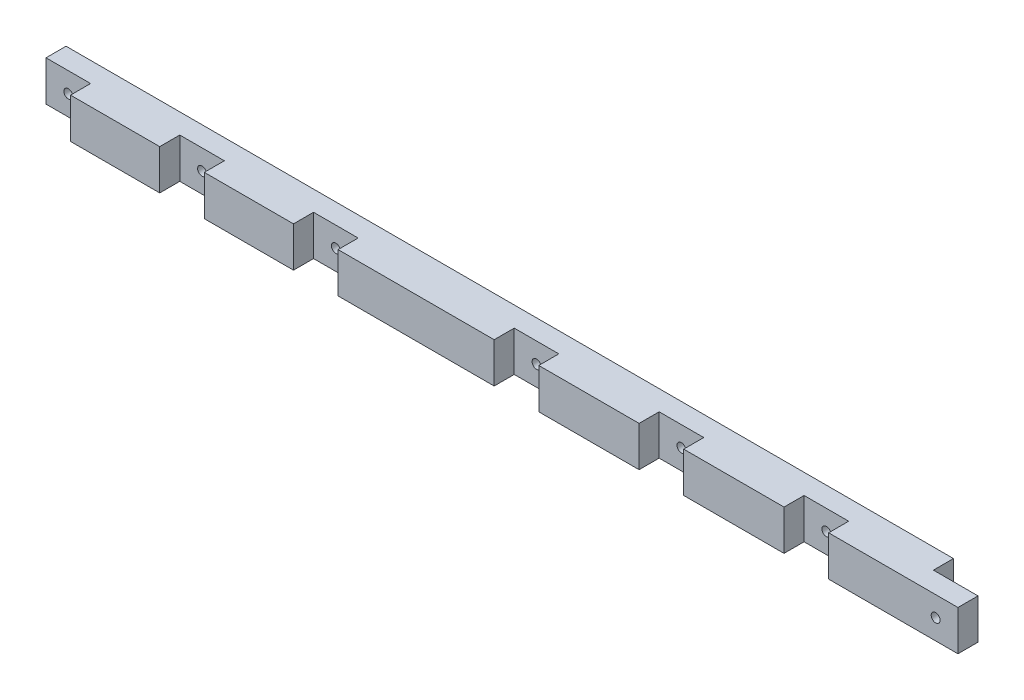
ISO-10303-21;
HEADER;
FILE_DESCRIPTION(('STEP AP214'),'2;1');
FILE_NAME('part.step','',(''),(''),'','','');
FILE_SCHEMA(('AUTOMOTIVE_DESIGN { 1 0 10303 214 1 1 1 1 }'));
ENDSEC;
DATA;
#1=APPLICATION_CONTEXT('core data for automotive mechanical design processes');
#2=APPLICATION_PROTOCOL_DEFINITION('international standard','automotive_design',2000,#1);
#3=PRODUCT_CONTEXT('',#1,'mechanical');
#4=PRODUCT('Part','Part','',(#3));
#5=PRODUCT_RELATED_PRODUCT_CATEGORY('part','',(#4));
#6=PRODUCT_DEFINITION_FORMATION('','',#4);
#7=PRODUCT_DEFINITION_CONTEXT('part definition',#1,'design');
#8=PRODUCT_DEFINITION('design','',#6,#7);
#9=PRODUCT_DEFINITION_SHAPE('','',#8);
#10=(LENGTH_UNIT() NAMED_UNIT(*) SI_UNIT(.MILLI.,.METRE.));
#11=(NAMED_UNIT(*) PLANE_ANGLE_UNIT() SI_UNIT($,.RADIAN.));
#12=(NAMED_UNIT(*) SI_UNIT($,.STERADIAN.) SOLID_ANGLE_UNIT());
#13=UNCERTAINTY_MEASURE_WITH_UNIT(LENGTH_MEASURE(1.E-05),#10,'distance_accuracy_value','');
#14=(GEOMETRIC_REPRESENTATION_CONTEXT(3) GLOBAL_UNCERTAINTY_ASSIGNED_CONTEXT((#13)) GLOBAL_UNIT_ASSIGNED_CONTEXT((#10,
#11,#12)) REPRESENTATION_CONTEXT('',''));
#15=CARTESIAN_POINT('',(0.,0.,0.));
#16=DIRECTION('',(0.,0.,1.));
#17=DIRECTION('',(1.,0.,0.));
#18=AXIS2_PLACEMENT_3D('',#15,#16,#17);
#19=CARTESIAN_POINT('',(209.,0.,9.));
#20=DIRECTION('',(-1.,0.,0.));
#21=DIRECTION('',(0.,0.,1.));
#22=AXIS2_PLACEMENT_3D('',#19,#20,#21);
#23=PLANE('',#22);
#24=DIRECTION('',(0.,-1.,0.));
#25=VECTOR('',#24,1.);
#26=CARTESIAN_POINT('',(209.,9.,4.5));
#27=LINE('',#26,#25);
#28=CARTESIAN_POINT('',(209.,9.,4.5));
#29=VERTEX_POINT('',#28);
#30=CARTESIAN_POINT('',(209.,0.,4.5));
#31=VERTEX_POINT('',#30);
#32=EDGE_CURVE('E215',#29,#31,#27,.T.);
#33=ORIENTED_EDGE('',*,*,#32,.F.);
#34=DIRECTION('',(0.,0.,-1.));
#35=VECTOR('',#34,1.);
#36=CARTESIAN_POINT('',(209.,9.,9.));
#37=LINE('',#36,#35);
#38=CARTESIAN_POINT('',(209.,9.,9.));
#39=VERTEX_POINT('',#38);
#40=EDGE_CURVE('E237',#39,#29,#37,.T.);
#41=ORIENTED_EDGE('',*,*,#40,.F.);
#42=DIRECTION('',(0.,1.,0.));
#43=VECTOR('',#42,1.);
#44=CARTESIAN_POINT('',(209.,0.,9.));
#45=LINE('',#44,#43);
#46=CARTESIAN_POINT('',(209.,0.,9.));
#47=VERTEX_POINT('',#46);
#48=EDGE_CURVE('E236',#47,#39,#45,.T.);
#49=ORIENTED_EDGE('',*,*,#48,.F.);
#50=DIRECTION('',(0.,0.,-1.));
#51=VECTOR('',#50,1.);
#52=CARTESIAN_POINT('',(209.,0.,9.));
#53=LINE('',#52,#51);
#54=EDGE_CURVE('E39',#47,#31,#53,.T.);
#55=ORIENTED_EDGE('',*,*,#54,.T.);
#56=EDGE_LOOP('',(#33,#41,#49,#55));
#57=FACE_BOUND('',#56,.T.);
#58=ADVANCED_FACE('F31',(#57),#23,.F.);
#59=CARTESIAN_POINT('',(0.,9.,9.));
#60=DIRECTION('',(0.,0.,-1.));
#61=DIRECTION('',(-1.,0.,0.));
#62=AXIS2_PLACEMENT_3D('',#59,#60,#61);
#63=PLANE('',#62);
#64=DIRECTION('',(1.,0.,0.));
#65=VECTOR('',#64,1.);
#66=CARTESIAN_POINT('',(0.,0.,9.));
#67=LINE('',#66,#65);
#68=CARTESIAN_POINT('',(147.5,0.,9.));
#69=VERTEX_POINT('',#68);
#70=CARTESIAN_POINT('',(170.,0.,9.));
#71=VERTEX_POINT('',#70);
#72=EDGE_CURVE('E517',#69,#71,#67,.T.);
#73=ORIENTED_EDGE('',*,*,#72,.T.);
#74=DIRECTION('',(0.,-1.,0.));
#75=VECTOR('',#74,1.);
#76=CARTESIAN_POINT('',(170.,0.,9.));
#77=LINE('',#76,#75);
#78=CARTESIAN_POINT('',(170.,9.,9.));
#79=VERTEX_POINT('',#78);
#80=EDGE_CURVE('E430',#79,#71,#77,.T.);
#81=ORIENTED_EDGE('',*,*,#80,.F.);
#82=DIRECTION('',(-1.,0.,0.));
#83=VECTOR('',#82,1.);
#84=CARTESIAN_POINT('',(0.,9.,9.));
#85=LINE('',#84,#83);
#86=CARTESIAN_POINT('',(147.5,9.,9.));
#87=VERTEX_POINT('',#86);
#88=EDGE_CURVE('E255',#79,#87,#85,.T.);
#89=ORIENTED_EDGE('',*,*,#88,.T.);
#90=DIRECTION('',(0.,1.,0.));
#91=VECTOR('',#90,1.);
#92=CARTESIAN_POINT('',(147.5,0.,9.));
#93=LINE('',#92,#91);
#94=EDGE_CURVE('E395',#69,#87,#93,.T.);
#95=ORIENTED_EDGE('',*,*,#94,.F.);
#96=EDGE_LOOP('',(#73,#81,#89,#95));
#97=FACE_BOUND('',#96,.T.);
#98=ADVANCED_FACE('F480',(#97),#63,.F.);
#99=CARTESIAN_POINT('',(115.,0.,9.));
#100=VERTEX_POINT('',#99);
#101=CARTESIAN_POINT('',(137.5,0.,9.));
#102=VERTEX_POINT('',#101);
#103=EDGE_CURVE('E519',#100,#102,#67,.T.);
#104=ORIENTED_EDGE('',*,*,#103,.T.);
#105=DIRECTION('',(0.,-1.,0.));
#106=VECTOR('',#105,1.);
#107=CARTESIAN_POINT('',(137.5,0.,9.));
#108=LINE('',#107,#106);
#109=CARTESIAN_POINT('',(137.5,9.,9.));
#110=VERTEX_POINT('',#109);
#111=EDGE_CURVE('E399',#110,#102,#108,.T.);
#112=ORIENTED_EDGE('',*,*,#111,.F.);
#113=CARTESIAN_POINT('',(115.,9.,9.));
#114=VERTEX_POINT('',#113);
#115=EDGE_CURVE('E553',#110,#114,#85,.T.);
#116=ORIENTED_EDGE('',*,*,#115,.T.);
#117=DIRECTION('',(0.,1.,0.));
#118=VECTOR('',#117,1.);
#119=CARTESIAN_POINT('',(115.,0.,9.));
#120=LINE('',#119,#118);
#121=EDGE_CURVE('E362',#100,#114,#120,.T.);
#122=ORIENTED_EDGE('',*,*,#121,.F.);
#123=EDGE_LOOP('',(#104,#112,#116,#122));
#124=FACE_BOUND('',#123,.T.);
#125=ADVANCED_FACE('F485',(#124),#63,.F.);
#126=CARTESIAN_POINT('',(70.,0.,9.));
#127=VERTEX_POINT('',#126);
#128=CARTESIAN_POINT('',(105.,0.,9.));
#129=VERTEX_POINT('',#128);
#130=EDGE_CURVE('E524',#127,#129,#67,.T.);
#131=ORIENTED_EDGE('',*,*,#130,.T.);
#132=DIRECTION('',(0.,-1.,0.));
#133=VECTOR('',#132,1.);
#134=CARTESIAN_POINT('',(105.,0.,9.));
#135=LINE('',#134,#133);
#136=CARTESIAN_POINT('',(105.,9.,9.));
#137=VERTEX_POINT('',#136);
#138=EDGE_CURVE('E366',#137,#129,#135,.T.);
#139=ORIENTED_EDGE('',*,*,#138,.F.);
#140=CARTESIAN_POINT('',(70.,9.,9.));
#141=VERTEX_POINT('',#140);
#142=EDGE_CURVE('E552',#137,#141,#85,.T.);
#143=ORIENTED_EDGE('',*,*,#142,.T.);
#144=DIRECTION('',(0.,1.,0.));
#145=VECTOR('',#144,1.);
#146=CARTESIAN_POINT('',(70.,0.,9.));
#147=LINE('',#146,#145);
#148=EDGE_CURVE('E329',#127,#141,#147,.T.);
#149=ORIENTED_EDGE('',*,*,#148,.F.);
#150=EDGE_LOOP('',(#131,#139,#143,#149));
#151=FACE_BOUND('',#150,.T.);
#152=ADVANCED_FACE('F645',(#151),#63,.F.);
#153=CARTESIAN_POINT('',(40.,0.,9.));
#154=VERTEX_POINT('',#153);
#155=CARTESIAN_POINT('',(60.,0.,9.));
#156=VERTEX_POINT('',#155);
#157=EDGE_CURVE('E261',#154,#156,#67,.T.);
#158=ORIENTED_EDGE('',*,*,#157,.T.);
#159=DIRECTION('',(0.,-1.,0.));
#160=VECTOR('',#159,1.);
#161=CARTESIAN_POINT('',(60.,0.,9.));
#162=LINE('',#161,#160);
#163=CARTESIAN_POINT('',(60.,9.,9.));
#164=VERTEX_POINT('',#163);
#165=EDGE_CURVE('E333',#164,#156,#162,.T.);
#166=ORIENTED_EDGE('',*,*,#165,.F.);
#167=CARTESIAN_POINT('',(40.,9.,9.));
#168=VERTEX_POINT('',#167);
#169=EDGE_CURVE('E550',#164,#168,#85,.T.);
#170=ORIENTED_EDGE('',*,*,#169,.T.);
#171=DIRECTION('',(0.,1.,0.));
#172=VECTOR('',#171,1.);
#173=CARTESIAN_POINT('',(40.,0.,9.));
#174=LINE('',#173,#172);
#175=EDGE_CURVE('E296',#154,#168,#174,.T.);
#176=ORIENTED_EDGE('',*,*,#175,.F.);
#177=EDGE_LOOP('',(#158,#166,#170,#176));
#178=FACE_BOUND('',#177,.T.);
#179=ADVANCED_FACE('F502',(#178),#63,.F.);
#180=CARTESIAN_POINT('',(10.,0.,9.));
#181=VERTEX_POINT('',#180);
#182=CARTESIAN_POINT('',(30.,0.,9.));
#183=VERTEX_POINT('',#182);
#184=EDGE_CURVE('E258',#181,#183,#67,.T.);
#185=ORIENTED_EDGE('',*,*,#184,.T.);
#186=DIRECTION('',(0.,-1.,0.));
#187=VECTOR('',#186,1.);
#188=CARTESIAN_POINT('',(30.,0.,9.));
#189=LINE('',#188,#187);
#190=CARTESIAN_POINT('',(30.,9.,9.));
#191=VERTEX_POINT('',#190);
#192=EDGE_CURVE('E300',#191,#183,#189,.T.);
#193=ORIENTED_EDGE('',*,*,#192,.F.);
#194=CARTESIAN_POINT('',(10.,9.,9.));
#195=VERTEX_POINT('',#194);
#196=EDGE_CURVE('E256',#191,#195,#85,.T.);
#197=ORIENTED_EDGE('',*,*,#196,.T.);
#198=DIRECTION('',(0.,1.,0.));
#199=VECTOR('',#198,1.);
#200=CARTESIAN_POINT('',(10.,0.,9.));
#201=LINE('',#200,#199);
#202=EDGE_CURVE('E267',#181,#195,#201,.T.);
#203=ORIENTED_EDGE('',*,*,#202,.F.);
#204=EDGE_LOOP('',(#185,#193,#197,#203));
#205=FACE_BOUND('',#204,.T.);
#206=ADVANCED_FACE('F497',(#205),#63,.F.);
#207=CARTESIAN_POINT('',(0.,0.,9.));
#208=DIRECTION('',(1.,0.,0.));
#209=DIRECTION('',(0.,0.,-1.));
#210=AXIS2_PLACEMENT_3D('',#207,#208,#209);
#211=PLANE('',#210);
#212=DIRECTION('',(0.,0.,-1.));
#213=VECTOR('',#212,1.);
#214=CARTESIAN_POINT('',(0.,0.,9.));
#215=LINE('',#214,#213);
#216=CARTESIAN_POINT('',(0.,0.,4.5));
#217=VERTEX_POINT('',#216);
#218=CARTESIAN_POINT('',(0.,0.,0.));
#219=VERTEX_POINT('',#218);
#220=EDGE_CURVE('E11',#217,#219,#215,.T.);
#221=ORIENTED_EDGE('',*,*,#220,.F.);
#222=DIRECTION('',(0.,-1.,0.));
#223=VECTOR('',#222,1.);
#224=CARTESIAN_POINT('',(0.,0.,4.5));
#225=LINE('',#224,#223);
#226=CARTESIAN_POINT('',(0.,9.,4.5));
#227=VERTEX_POINT('',#226);
#228=EDGE_CURVE('E270',#227,#217,#225,.T.);
#229=ORIENTED_EDGE('',*,*,#228,.F.);
#230=DIRECTION('',(0.,0.,-1.));
#231=VECTOR('',#230,1.);
#232=CARTESIAN_POINT('',(0.,9.,9.));
#233=LINE('',#232,#231);
#234=CARTESIAN_POINT('',(0.,9.,0.));
#235=VERTEX_POINT('',#234);
#236=EDGE_CURVE('E238',#227,#235,#233,.T.);
#237=ORIENTED_EDGE('',*,*,#236,.T.);
#238=DIRECTION('',(0.,-1.,0.));
#239=VECTOR('',#238,1.);
#240=CARTESIAN_POINT('',(0.,0.,0.));
#241=LINE('',#240,#239);
#242=EDGE_CURVE('E249',#235,#219,#241,.T.);
#243=ORIENTED_EDGE('',*,*,#242,.T.);
#244=EDGE_LOOP('',(#221,#229,#237,#243));
#245=FACE_BOUND('',#244,.T.);
#246=ADVANCED_FACE('F33',(#245),#211,.F.);
#247=CARTESIAN_POINT('',(0.,0.,9.));
#248=DIRECTION('',(0.,1.,0.));
#249=DIRECTION('',(0.,0.,1.));
#250=AXIS2_PLACEMENT_3D('',#247,#248,#249);
#251=PLANE('',#250);
#252=DIRECTION('',(1.,0.,0.));
#253=VECTOR('',#252,1.);
#254=CARTESIAN_POINT('',(0.,0.,0.));
#255=LINE('',#254,#253);
#256=CARTESIAN_POINT('',(199.,0.,0.));
#257=VERTEX_POINT('',#256);
#258=EDGE_CURVE('E247',#219,#257,#255,.T.);
#259=ORIENTED_EDGE('',*,*,#258,.T.);
#260=DIRECTION('',(0.,0.,-1.));
#261=VECTOR('',#260,1.);
#262=CARTESIAN_POINT('',(199.,0.,4.5));
#263=LINE('',#262,#261);
#264=CARTESIAN_POINT('',(199.,0.,4.5));
#265=VERTEX_POINT('',#264);
#266=EDGE_CURVE('E46',#265,#257,#263,.T.);
#267=ORIENTED_EDGE('',*,*,#266,.F.);
#268=DIRECTION('',(-1.,0.,0.));
#269=VECTOR('',#268,1.);
#270=CARTESIAN_POINT('',(209.,0.,4.5));
#271=LINE('',#270,#269);
#272=EDGE_CURVE('E219',#31,#265,#271,.T.);
#273=ORIENTED_EDGE('',*,*,#272,.F.);
#274=ORIENTED_EDGE('',*,*,#54,.F.);
#275=CARTESIAN_POINT('',(180.,0.,9.));
#276=VERTEX_POINT('',#275);
#277=EDGE_CURVE('E246',#276,#47,#67,.T.);
#278=ORIENTED_EDGE('',*,*,#277,.F.);
#279=DIRECTION('',(0.,0.,1.));
#280=VECTOR('',#279,1.);
#281=CARTESIAN_POINT('',(180.,0.,4.5));
#282=LINE('',#281,#280);
#283=CARTESIAN_POINT('',(180.,0.,4.5));
#284=VERTEX_POINT('',#283);
#285=EDGE_CURVE('E54',#284,#276,#282,.T.);
#286=ORIENTED_EDGE('',*,*,#285,.F.);
#287=DIRECTION('',(1.,0.,0.));
#288=VECTOR('',#287,1.);
#289=CARTESIAN_POINT('',(170.,0.,4.5));
#290=LINE('',#289,#288);
#291=CARTESIAN_POINT('',(170.,0.,4.5));
#292=VERTEX_POINT('',#291);
#293=EDGE_CURVE('E438',#292,#284,#290,.T.);
#294=ORIENTED_EDGE('',*,*,#293,.F.);
#295=DIRECTION('',(0.,0.,1.));
#296=VECTOR('',#295,1.);
#297=CARTESIAN_POINT('',(170.,0.,4.5));
#298=LINE('',#297,#296);
#299=EDGE_CURVE('E418',#292,#71,#298,.T.);
#300=ORIENTED_EDGE('',*,*,#299,.T.);
#301=ORIENTED_EDGE('',*,*,#72,.F.);
#302=DIRECTION('',(0.,0.,1.));
#303=VECTOR('',#302,1.);
#304=CARTESIAN_POINT('',(147.5,0.,4.5));
#305=LINE('',#304,#303);
#306=CARTESIAN_POINT('',(147.5,0.,4.5));
#307=VERTEX_POINT('',#306);
#308=EDGE_CURVE('E388',#307,#69,#305,.T.);
#309=ORIENTED_EDGE('',*,*,#308,.F.);
#310=DIRECTION('',(1.,0.,0.));
#311=VECTOR('',#310,1.);
#312=CARTESIAN_POINT('',(137.5,0.,4.5));
#313=LINE('',#312,#311);
#314=CARTESIAN_POINT('',(137.5,0.,4.5));
#315=VERTEX_POINT('',#314);
#316=EDGE_CURVE('E407',#315,#307,#313,.T.);
#317=ORIENTED_EDGE('',*,*,#316,.F.);
#318=DIRECTION('',(0.,0.,1.));
#319=VECTOR('',#318,1.);
#320=CARTESIAN_POINT('',(137.5,0.,4.5));
#321=LINE('',#320,#319);
#322=EDGE_CURVE('E385',#315,#102,#321,.T.);
#323=ORIENTED_EDGE('',*,*,#322,.T.);
#324=ORIENTED_EDGE('',*,*,#103,.F.);
#325=DIRECTION('',(0.,0.,1.));
#326=VECTOR('',#325,1.);
#327=CARTESIAN_POINT('',(115.,0.,4.5));
#328=LINE('',#327,#326);
#329=CARTESIAN_POINT('',(115.,0.,4.5));
#330=VERTEX_POINT('',#329);
#331=EDGE_CURVE('E355',#330,#100,#328,.T.);
#332=ORIENTED_EDGE('',*,*,#331,.F.);
#333=DIRECTION('',(1.,0.,0.));
#334=VECTOR('',#333,1.);
#335=CARTESIAN_POINT('',(105.,0.,4.5));
#336=LINE('',#335,#334);
#337=CARTESIAN_POINT('',(105.,0.,4.5));
#338=VERTEX_POINT('',#337);
#339=EDGE_CURVE('E374',#338,#330,#336,.T.);
#340=ORIENTED_EDGE('',*,*,#339,.F.);
#341=DIRECTION('',(0.,0.,1.));
#342=VECTOR('',#341,1.);
#343=CARTESIAN_POINT('',(105.,0.,4.5));
#344=LINE('',#343,#342);
#345=EDGE_CURVE('E352',#338,#129,#344,.T.);
#346=ORIENTED_EDGE('',*,*,#345,.T.);
#347=ORIENTED_EDGE('',*,*,#130,.F.);
#348=DIRECTION('',(0.,0.,1.));
#349=VECTOR('',#348,1.);
#350=CARTESIAN_POINT('',(70.,0.,4.5));
#351=LINE('',#350,#349);
#352=CARTESIAN_POINT('',(70.,0.,4.5));
#353=VERTEX_POINT('',#352);
#354=EDGE_CURVE('E322',#353,#127,#351,.T.);
#355=ORIENTED_EDGE('',*,*,#354,.F.);
#356=DIRECTION('',(1.,0.,0.));
#357=VECTOR('',#356,1.);
#358=CARTESIAN_POINT('',(60.,0.,4.5));
#359=LINE('',#358,#357);
#360=CARTESIAN_POINT('',(60.,0.,4.5));
#361=VERTEX_POINT('',#360);
#362=EDGE_CURVE('E341',#361,#353,#359,.T.);
#363=ORIENTED_EDGE('',*,*,#362,.F.);
#364=DIRECTION('',(0.,0.,1.));
#365=VECTOR('',#364,1.);
#366=CARTESIAN_POINT('',(60.,0.,4.5));
#367=LINE('',#366,#365);
#368=EDGE_CURVE('E319',#361,#156,#367,.T.);
#369=ORIENTED_EDGE('',*,*,#368,.T.);
#370=ORIENTED_EDGE('',*,*,#157,.F.);
#371=DIRECTION('',(0.,0.,1.));
#372=VECTOR('',#371,1.);
#373=CARTESIAN_POINT('',(40.,0.,4.5));
#374=LINE('',#373,#372);
#375=CARTESIAN_POINT('',(40.,0.,4.5));
#376=VERTEX_POINT('',#375);
#377=EDGE_CURVE('E289',#376,#154,#374,.T.);
#378=ORIENTED_EDGE('',*,*,#377,.F.);
#379=DIRECTION('',(1.,0.,0.));
#380=VECTOR('',#379,1.);
#381=CARTESIAN_POINT('',(30.,0.,4.5));
#382=LINE('',#381,#380);
#383=CARTESIAN_POINT('',(30.,0.,4.5));
#384=VERTEX_POINT('',#383);
#385=EDGE_CURVE('E308',#384,#376,#382,.T.);
#386=ORIENTED_EDGE('',*,*,#385,.F.);
#387=DIRECTION('',(0.,0.,1.));
#388=VECTOR('',#387,1.);
#389=CARTESIAN_POINT('',(30.,0.,4.5));
#390=LINE('',#389,#388);
#391=EDGE_CURVE('E286',#384,#183,#390,.T.);
#392=ORIENTED_EDGE('',*,*,#391,.T.);
#393=ORIENTED_EDGE('',*,*,#184,.F.);
#394=DIRECTION('',(0.,0.,1.));
#395=VECTOR('',#394,1.);
#396=CARTESIAN_POINT('',(10.,0.,4.5));
#397=LINE('',#396,#395);
#398=CARTESIAN_POINT('',(10.,0.,4.5));
#399=VERTEX_POINT('',#398);
#400=EDGE_CURVE('E262',#399,#181,#397,.T.);
#401=ORIENTED_EDGE('',*,*,#400,.F.);
#402=DIRECTION('',(1.,0.,0.));
#403=VECTOR('',#402,1.);
#404=CARTESIAN_POINT('',(0.,0.,4.5));
#405=LINE('',#404,#403);
#406=EDGE_CURVE('E276',#217,#399,#405,.T.);
#407=ORIENTED_EDGE('',*,*,#406,.F.);
#408=ORIENTED_EDGE('',*,*,#220,.T.);
#409=EDGE_LOOP('',(#259,#267,#273,#274,#278,#286,#294,#300,#301,#309,#317,#323,#324,#332,#340,
#346,#347,#355,#363,#369,#370,#378,#386,#392,#393,#401,#407,#408));
#410=FACE_BOUND('',#409,.T.);
#411=ADVANCED_FACE('F231',(#410),#251,.F.);
#412=CARTESIAN_POINT('',(0.,9.,9.));
#413=DIRECTION('',(0.,-1.,0.));
#414=DIRECTION('',(0.,0.,-1.));
#415=AXIS2_PLACEMENT_3D('',#412,#413,#414);
#416=PLANE('',#415);
#417=DIRECTION('',(1.,0.,0.));
#418=VECTOR('',#417,1.);
#419=CARTESIAN_POINT('',(209.,9.,4.5));
#420=LINE('',#419,#418);
#421=CARTESIAN_POINT('',(199.,9.,4.5));
#422=VERTEX_POINT('',#421);
#423=EDGE_CURVE('E221',#422,#29,#420,.T.);
#424=ORIENTED_EDGE('',*,*,#423,.F.);
#425=DIRECTION('',(0.,0.,-1.));
#426=VECTOR('',#425,1.);
#427=CARTESIAN_POINT('',(199.,9.,4.5));
#428=LINE('',#427,#426);
#429=CARTESIAN_POINT('',(199.,9.,0.));
#430=VERTEX_POINT('',#429);
#431=EDGE_CURVE('E446',#422,#430,#428,.T.);
#432=ORIENTED_EDGE('',*,*,#431,.T.);
#433=DIRECTION('',(-1.,0.,0.));
#434=VECTOR('',#433,1.);
#435=CARTESIAN_POINT('',(0.,9.,0.));
#436=LINE('',#435,#434);
#437=EDGE_CURVE('E244',#430,#235,#436,.T.);
#438=ORIENTED_EDGE('',*,*,#437,.T.);
#439=ORIENTED_EDGE('',*,*,#236,.F.);
#440=DIRECTION('',(-1.,0.,0.));
#441=VECTOR('',#440,1.);
#442=CARTESIAN_POINT('',(0.,9.,4.5));
#443=LINE('',#442,#441);
#444=CARTESIAN_POINT('',(10.,9.,4.5));
#445=VERTEX_POINT('',#444);
#446=EDGE_CURVE('E264',#445,#227,#443,.T.);
#447=ORIENTED_EDGE('',*,*,#446,.F.);
#448=DIRECTION('',(0.,0.,1.));
#449=VECTOR('',#448,1.);
#450=CARTESIAN_POINT('',(10.,9.,4.5));
#451=LINE('',#450,#449);
#452=EDGE_CURVE('E252',#445,#195,#451,.T.);
#453=ORIENTED_EDGE('',*,*,#452,.T.);
#454=ORIENTED_EDGE('',*,*,#196,.F.);
#455=DIRECTION('',(0.,0.,1.));
#456=VECTOR('',#455,1.);
#457=CARTESIAN_POINT('',(30.,9.,4.5));
#458=LINE('',#457,#456);
#459=CARTESIAN_POINT('',(30.,9.,4.5));
#460=VERTEX_POINT('',#459);
#461=EDGE_CURVE('E283',#460,#191,#458,.T.);
#462=ORIENTED_EDGE('',*,*,#461,.F.);
#463=DIRECTION('',(-1.,0.,0.));
#464=VECTOR('',#463,1.);
#465=CARTESIAN_POINT('',(30.,9.,4.5));
#466=LINE('',#465,#464);
#467=CARTESIAN_POINT('',(40.,9.,4.5));
#468=VERTEX_POINT('',#467);
#469=EDGE_CURVE('E290',#468,#460,#466,.T.);
#470=ORIENTED_EDGE('',*,*,#469,.F.);
#471=DIRECTION('',(0.,0.,1.));
#472=VECTOR('',#471,1.);
#473=CARTESIAN_POINT('',(40.,9.,4.5));
#474=LINE('',#473,#472);
#475=EDGE_CURVE('E292',#468,#168,#474,.T.);
#476=ORIENTED_EDGE('',*,*,#475,.T.);
#477=ORIENTED_EDGE('',*,*,#169,.F.);
#478=DIRECTION('',(0.,0.,1.));
#479=VECTOR('',#478,1.);
#480=CARTESIAN_POINT('',(60.,9.,4.5));
#481=LINE('',#480,#479);
#482=CARTESIAN_POINT('',(60.,9.,4.5));
#483=VERTEX_POINT('',#482);
#484=EDGE_CURVE('E316',#483,#164,#481,.T.);
#485=ORIENTED_EDGE('',*,*,#484,.F.);
#486=DIRECTION('',(-1.,0.,0.));
#487=VECTOR('',#486,1.);
#488=CARTESIAN_POINT('',(60.,9.,4.5));
#489=LINE('',#488,#487);
#490=CARTESIAN_POINT('',(70.,9.,4.5));
#491=VERTEX_POINT('',#490);
#492=EDGE_CURVE('E323',#491,#483,#489,.T.);
#493=ORIENTED_EDGE('',*,*,#492,.F.);
#494=DIRECTION('',(0.,0.,1.));
#495=VECTOR('',#494,1.);
#496=CARTESIAN_POINT('',(70.,9.,4.5));
#497=LINE('',#496,#495);
#498=EDGE_CURVE('E325',#491,#141,#497,.T.);
#499=ORIENTED_EDGE('',*,*,#498,.T.);
#500=ORIENTED_EDGE('',*,*,#142,.F.);
#501=DIRECTION('',(0.,0.,1.));
#502=VECTOR('',#501,1.);
#503=CARTESIAN_POINT('',(105.,9.,4.5));
#504=LINE('',#503,#502);
#505=CARTESIAN_POINT('',(105.,9.,4.5));
#506=VERTEX_POINT('',#505);
#507=EDGE_CURVE('E349',#506,#137,#504,.T.);
#508=ORIENTED_EDGE('',*,*,#507,.F.);
#509=DIRECTION('',(-1.,0.,0.));
#510=VECTOR('',#509,1.);
#511=CARTESIAN_POINT('',(105.,9.,4.5));
#512=LINE('',#511,#510);
#513=CARTESIAN_POINT('',(115.,9.,4.5));
#514=VERTEX_POINT('',#513);
#515=EDGE_CURVE('E356',#514,#506,#512,.T.);
#516=ORIENTED_EDGE('',*,*,#515,.F.);
#517=DIRECTION('',(0.,0.,1.));
#518=VECTOR('',#517,1.);
#519=CARTESIAN_POINT('',(115.,9.,4.5));
#520=LINE('',#519,#518);
#521=EDGE_CURVE('E358',#514,#114,#520,.T.);
#522=ORIENTED_EDGE('',*,*,#521,.T.);
#523=ORIENTED_EDGE('',*,*,#115,.F.);
#524=DIRECTION('',(0.,0.,1.));
#525=VECTOR('',#524,1.);
#526=CARTESIAN_POINT('',(137.5,9.,4.5));
#527=LINE('',#526,#525);
#528=CARTESIAN_POINT('',(137.5,9.,4.5));
#529=VERTEX_POINT('',#528);
#530=EDGE_CURVE('E382',#529,#110,#527,.T.);
#531=ORIENTED_EDGE('',*,*,#530,.F.);
#532=DIRECTION('',(-1.,0.,0.));
#533=VECTOR('',#532,1.);
#534=CARTESIAN_POINT('',(137.5,9.,4.5));
#535=LINE('',#534,#533);
#536=CARTESIAN_POINT('',(147.5,9.,4.5));
#537=VERTEX_POINT('',#536);
#538=EDGE_CURVE('E389',#537,#529,#535,.T.);
#539=ORIENTED_EDGE('',*,*,#538,.F.);
#540=DIRECTION('',(0.,0.,1.));
#541=VECTOR('',#540,1.);
#542=CARTESIAN_POINT('',(147.5,9.,4.5));
#543=LINE('',#542,#541);
#544=EDGE_CURVE('E391',#537,#87,#543,.T.);
#545=ORIENTED_EDGE('',*,*,#544,.T.);
#546=ORIENTED_EDGE('',*,*,#88,.F.);
#547=DIRECTION('',(0.,0.,1.));
#548=VECTOR('',#547,1.);
#549=CARTESIAN_POINT('',(170.,9.,4.5));
#550=LINE('',#549,#548);
#551=CARTESIAN_POINT('',(170.,9.,4.5));
#552=VERTEX_POINT('',#551);
#553=EDGE_CURVE('E415',#552,#79,#550,.T.);
#554=ORIENTED_EDGE('',*,*,#553,.F.);
#555=DIRECTION('',(-1.,0.,0.));
#556=VECTOR('',#555,1.);
#557=CARTESIAN_POINT('',(170.,9.,4.5));
#558=LINE('',#557,#556);
#559=CARTESIAN_POINT('',(180.,9.,4.5));
#560=VERTEX_POINT('',#559);
#561=EDGE_CURVE('E421',#560,#552,#558,.T.);
#562=ORIENTED_EDGE('',*,*,#561,.F.);
#563=DIRECTION('',(0.,0.,1.));
#564=VECTOR('',#563,1.);
#565=CARTESIAN_POINT('',(180.,9.,4.5));
#566=LINE('',#565,#564);
#567=CARTESIAN_POINT('',(180.,9.,9.));
#568=VERTEX_POINT('',#567);
#569=EDGE_CURVE('E423',#560,#568,#566,.T.);
#570=ORIENTED_EDGE('',*,*,#569,.T.);
#571=EDGE_CURVE('E243',#39,#568,#85,.T.);
#572=ORIENTED_EDGE('',*,*,#571,.F.);
#573=ORIENTED_EDGE('',*,*,#40,.T.);
#574=EDGE_LOOP('',(#424,#432,#438,#439,#447,#453,#454,#462,#470,#476,#477,#485,#493,#499,#500,
#508,#516,#522,#523,#531,#539,#545,#546,#554,#562,#570,#572,#573));
#575=FACE_BOUND('',#574,.T.);
#576=ADVANCED_FACE('F489',(#575),#416,.F.);
#577=CARTESIAN_POINT('',(204.,4.5,9.));
#578=DIRECTION('',(0.,0.,-1.));
#579=DIRECTION('',(-1.,0.,0.));
#580=AXIS2_PLACEMENT_3D('',#577,#578,#579);
#581=CIRCLE('',#580,0.999999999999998);
#582=CARTESIAN_POINT('',(203.,4.5,9.));
#583=VERTEX_POINT('',#582);
#584=EDGE_CURVE('E453',#583,#583,#581,.T.);
#585=ORIENTED_EDGE('',*,*,#584,.T.);
#586=EDGE_LOOP('',(#585));
#587=FACE_BOUND('',#586,.T.);
#588=ORIENTED_EDGE('',*,*,#571,.T.);
#589=DIRECTION('',(0.,1.,0.));
#590=VECTOR('',#589,1.);
#591=CARTESIAN_POINT('',(180.,0.,9.));
#592=LINE('',#591,#590);
#593=EDGE_CURVE('E427',#276,#568,#592,.T.);
#594=ORIENTED_EDGE('',*,*,#593,.F.);
#595=ORIENTED_EDGE('',*,*,#277,.T.);
#596=ORIENTED_EDGE('',*,*,#48,.T.);
#597=EDGE_LOOP('',(#588,#594,#595,#596));
#598=FACE_BOUND('',#597,.T.);
#599=ADVANCED_FACE('F462',(#587,#598),#63,.F.);
#600=CARTESIAN_POINT('',(0.,9.,0.));
#601=DIRECTION('',(0.,0.,-1.));
#602=DIRECTION('',(-1.,0.,0.));
#603=AXIS2_PLACEMENT_3D('',#600,#601,#602);
#604=PLANE('',#603);
#605=DIRECTION('',(0.,1.,0.));
#606=VECTOR('',#605,1.);
#607=CARTESIAN_POINT('',(199.,9.,0.));
#608=LINE('',#607,#606);
#609=EDGE_CURVE('E226',#257,#430,#608,.T.);
#610=ORIENTED_EDGE('',*,*,#609,.F.);
#611=ORIENTED_EDGE('',*,*,#258,.F.);
#612=ORIENTED_EDGE('',*,*,#242,.F.);
#613=ORIENTED_EDGE('',*,*,#437,.F.);
#614=EDGE_LOOP('',(#610,#611,#612,#613));
#615=FACE_BOUND('',#614,.T.);
#616=CARTESIAN_POINT('',(175.,4.5,0.));
#617=DIRECTION('',(0.,0.,1.));
#618=DIRECTION('',(1.,0.,0.));
#619=AXIS2_PLACEMENT_3D('',#616,#617,#618);
#620=CIRCLE('',#619,0.999999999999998);
#621=CARTESIAN_POINT('',(176.,4.5,0.));
#622=VERTEX_POINT('',#621);
#623=EDGE_CURVE('E432',#622,#622,#620,.T.);
#624=ORIENTED_EDGE('',*,*,#623,.T.);
#625=EDGE_LOOP('',(#624));
#626=FACE_BOUND('',#625,.T.);
#627=CARTESIAN_POINT('',(142.5,4.5,0.));
#628=DIRECTION('',(0.,0.,1.));
#629=DIRECTION('',(1.,0.,0.));
#630=AXIS2_PLACEMENT_3D('',#627,#628,#629);
#631=CIRCLE('',#630,0.999999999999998);
#632=CARTESIAN_POINT('',(143.5,4.5,0.));
#633=VERTEX_POINT('',#632);
#634=EDGE_CURVE('E401',#633,#633,#631,.T.);
#635=ORIENTED_EDGE('',*,*,#634,.T.);
#636=EDGE_LOOP('',(#635));
#637=FACE_BOUND('',#636,.T.);
#638=CARTESIAN_POINT('',(110.,4.5,0.));
#639=DIRECTION('',(0.,0.,1.));
#640=DIRECTION('',(1.,0.,0.));
#641=AXIS2_PLACEMENT_3D('',#638,#639,#640);
#642=CIRCLE('',#641,0.999999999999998);
#643=CARTESIAN_POINT('',(111.,4.5,0.));
#644=VERTEX_POINT('',#643);
#645=EDGE_CURVE('E368',#644,#644,#642,.T.);
#646=ORIENTED_EDGE('',*,*,#645,.T.);
#647=EDGE_LOOP('',(#646));
#648=FACE_BOUND('',#647,.T.);
#649=CARTESIAN_POINT('',(65.,4.5,0.));
#650=DIRECTION('',(0.,0.,1.));
#651=DIRECTION('',(1.,0.,0.));
#652=AXIS2_PLACEMENT_3D('',#649,#650,#651);
#653=CIRCLE('',#652,0.999999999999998);
#654=CARTESIAN_POINT('',(66.,4.5,0.));
#655=VERTEX_POINT('',#654);
#656=EDGE_CURVE('E335',#655,#655,#653,.T.);
#657=ORIENTED_EDGE('',*,*,#656,.T.);
#658=EDGE_LOOP('',(#657));
#659=FACE_BOUND('',#658,.T.);
#660=CARTESIAN_POINT('',(35.,4.5,0.));
#661=DIRECTION('',(0.,0.,1.));
#662=DIRECTION('',(1.,0.,0.));
#663=AXIS2_PLACEMENT_3D('',#660,#661,#662);
#664=CIRCLE('',#663,0.999999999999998);
#665=CARTESIAN_POINT('',(36.,4.5,0.));
#666=VERTEX_POINT('',#665);
#667=EDGE_CURVE('E302',#666,#666,#664,.T.);
#668=ORIENTED_EDGE('',*,*,#667,.T.);
#669=EDGE_LOOP('',(#668));
#670=FACE_BOUND('',#669,.T.);
#671=CARTESIAN_POINT('',(5.,4.5,0.));
#672=DIRECTION('',(0.,0.,1.));
#673=DIRECTION('',(1.,0.,0.));
#674=AXIS2_PLACEMENT_3D('',#671,#672,#673);
#675=CIRCLE('',#674,1.);
#676=CARTESIAN_POINT('',(6.,4.5,0.));
#677=VERTEX_POINT('',#676);
#678=EDGE_CURVE('E271',#677,#677,#675,.T.);
#679=ORIENTED_EDGE('',*,*,#678,.T.);
#680=EDGE_LOOP('',(#679));
#681=FACE_BOUND('',#680,.T.);
#682=ADVANCED_FACE('F512',(#615,#626,#637,#648,#659,#670,#681),#604,.T.);
#683=CARTESIAN_POINT('',(10.,0.,4.5));
#684=DIRECTION('',(1.,0.,0.));
#685=DIRECTION('',(0.,0.,-1.));
#686=AXIS2_PLACEMENT_3D('',#683,#684,#685);
#687=PLANE('',#686);
#688=ORIENTED_EDGE('',*,*,#202,.T.);
#689=ORIENTED_EDGE('',*,*,#452,.F.);
#690=DIRECTION('',(0.,1.,0.));
#691=VECTOR('',#690,1.);
#692=CARTESIAN_POINT('',(10.,0.,4.5));
#693=LINE('',#692,#691);
#694=EDGE_CURVE('E273',#399,#445,#693,.T.);
#695=ORIENTED_EDGE('',*,*,#694,.F.);
#696=ORIENTED_EDGE('',*,*,#400,.T.);
#697=EDGE_LOOP('',(#688,#689,#695,#696));
#698=FACE_BOUND('',#697,.T.);
#699=ADVANCED_FACE('F560',(#698),#687,.F.);
#700=CARTESIAN_POINT('',(0.,9.,4.5));
#701=DIRECTION('',(0.,0.,-1.));
#702=DIRECTION('',(-1.,0.,0.));
#703=AXIS2_PLACEMENT_3D('',#700,#701,#702);
#704=PLANE('',#703);
#705=CARTESIAN_POINT('',(5.,4.5,4.5));
#706=DIRECTION('',(0.,0.,1.));
#707=DIRECTION('',(1.,0.,0.));
#708=AXIS2_PLACEMENT_3D('',#705,#706,#707);
#709=CIRCLE('',#708,1.);
#710=CARTESIAN_POINT('',(6.,4.5,4.5));
#711=VERTEX_POINT('',#710);
#712=EDGE_CURVE('E280',#711,#711,#709,.T.);
#713=ORIENTED_EDGE('',*,*,#712,.F.);
#714=EDGE_LOOP('',(#713));
#715=FACE_BOUND('',#714,.T.);
#716=ORIENTED_EDGE('',*,*,#228,.T.);
#717=ORIENTED_EDGE('',*,*,#406,.T.);
#718=ORIENTED_EDGE('',*,*,#694,.T.);
#719=ORIENTED_EDGE('',*,*,#446,.T.);
#720=EDGE_LOOP('',(#716,#717,#718,#719));
#721=FACE_BOUND('',#720,.T.);
#722=ADVANCED_FACE('F563',(#715,#721),#704,.F.);
#723=CARTESIAN_POINT('',(5.,4.5,0.));
#724=DIRECTION('',(0.,0.,1.));
#725=DIRECTION('',(1.,0.,0.));
#726=AXIS2_PLACEMENT_3D('',#723,#724,#725);
#727=CYLINDRICAL_SURFACE('',#726,1.);
#728=ORIENTED_EDGE('',*,*,#678,.F.);
#729=EDGE_LOOP('',(#728));
#730=FACE_BOUND('',#729,.T.);
#731=ORIENTED_EDGE('',*,*,#712,.T.);
#732=EDGE_LOOP('',(#731));
#733=FACE_BOUND('',#732,.T.);
#734=ADVANCED_FACE('F579',(#730,#733),#727,.F.);
#735=CARTESIAN_POINT('',(30.,0.,4.5));
#736=DIRECTION('',(-1.,0.,0.));
#737=DIRECTION('',(0.,0.,1.));
#738=AXIS2_PLACEMENT_3D('',#735,#736,#737);
#739=PLANE('',#738);
#740=ORIENTED_EDGE('',*,*,#192,.T.);
#741=ORIENTED_EDGE('',*,*,#391,.F.);
#742=DIRECTION('',(0.,-1.,0.));
#743=VECTOR('',#742,1.);
#744=CARTESIAN_POINT('',(30.,0.,4.5));
#745=LINE('',#744,#743);
#746=EDGE_CURVE('E299',#460,#384,#745,.T.);
#747=ORIENTED_EDGE('',*,*,#746,.F.);
#748=ORIENTED_EDGE('',*,*,#461,.T.);
#749=EDGE_LOOP('',(#740,#741,#747,#748));
#750=FACE_BOUND('',#749,.T.);
#751=ADVANCED_FACE('F565',(#750),#739,.F.);
#752=CARTESIAN_POINT('',(40.,0.,4.5));
#753=DIRECTION('',(1.,0.,0.));
#754=DIRECTION('',(0.,0.,-1.));
#755=AXIS2_PLACEMENT_3D('',#752,#753,#754);
#756=PLANE('',#755);
#757=ORIENTED_EDGE('',*,*,#175,.T.);
#758=ORIENTED_EDGE('',*,*,#475,.F.);
#759=DIRECTION('',(0.,1.,0.));
#760=VECTOR('',#759,1.);
#761=CARTESIAN_POINT('',(40.,0.,4.5));
#762=LINE('',#761,#760);
#763=EDGE_CURVE('E305',#376,#468,#762,.T.);
#764=ORIENTED_EDGE('',*,*,#763,.F.);
#765=ORIENTED_EDGE('',*,*,#377,.T.);
#766=EDGE_LOOP('',(#757,#758,#764,#765));
#767=FACE_BOUND('',#766,.T.);
#768=ADVANCED_FACE('F569',(#767),#756,.F.);
#769=CARTESIAN_POINT('',(30.,9.,4.5));
#770=DIRECTION('',(0.,0.,-1.));
#771=DIRECTION('',(-1.,0.,0.));
#772=AXIS2_PLACEMENT_3D('',#769,#770,#771);
#773=PLANE('',#772);
#774=CARTESIAN_POINT('',(35.,4.5,4.5));
#775=DIRECTION('',(0.,0.,1.));
#776=DIRECTION('',(1.,0.,0.));
#777=AXIS2_PLACEMENT_3D('',#774,#775,#776);
#778=CIRCLE('',#777,0.999999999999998);
#779=CARTESIAN_POINT('',(36.,4.5,4.5));
#780=VERTEX_POINT('',#779);
#781=EDGE_CURVE('E313',#780,#780,#778,.T.);
#782=ORIENTED_EDGE('',*,*,#781,.F.);
#783=EDGE_LOOP('',(#782));
#784=FACE_BOUND('',#783,.T.);
#785=ORIENTED_EDGE('',*,*,#746,.T.);
#786=ORIENTED_EDGE('',*,*,#385,.T.);
#787=ORIENTED_EDGE('',*,*,#763,.T.);
#788=ORIENTED_EDGE('',*,*,#469,.T.);
#789=EDGE_LOOP('',(#785,#786,#787,#788));
#790=FACE_BOUND('',#789,.T.);
#791=ADVANCED_FACE('F567',(#784,#790),#773,.F.);
#792=CARTESIAN_POINT('',(35.,4.5,0.));
#793=DIRECTION('',(0.,0.,1.));
#794=DIRECTION('',(1.,0.,0.));
#795=AXIS2_PLACEMENT_3D('',#792,#793,#794);
#796=CYLINDRICAL_SURFACE('',#795,0.999999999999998);
#797=ORIENTED_EDGE('',*,*,#667,.F.);
#798=EDGE_LOOP('',(#797));
#799=FACE_BOUND('',#798,.T.);
#800=ORIENTED_EDGE('',*,*,#781,.T.);
#801=EDGE_LOOP('',(#800));
#802=FACE_BOUND('',#801,.T.);
#803=ADVANCED_FACE('F576',(#799,#802),#796,.F.);
#804=CARTESIAN_POINT('',(60.,0.,4.5));
#805=DIRECTION('',(-1.,0.,0.));
#806=DIRECTION('',(0.,0.,1.));
#807=AXIS2_PLACEMENT_3D('',#804,#805,#806);
#808=PLANE('',#807);
#809=ORIENTED_EDGE('',*,*,#165,.T.);
#810=ORIENTED_EDGE('',*,*,#368,.F.);
#811=DIRECTION('',(0.,-1.,0.));
#812=VECTOR('',#811,1.);
#813=CARTESIAN_POINT('',(60.,0.,4.5));
#814=LINE('',#813,#812);
#815=EDGE_CURVE('E332',#483,#361,#814,.T.);
#816=ORIENTED_EDGE('',*,*,#815,.F.);
#817=ORIENTED_EDGE('',*,*,#484,.T.);
#818=EDGE_LOOP('',(#809,#810,#816,#817));
#819=FACE_BOUND('',#818,.T.);
#820=ADVANCED_FACE('F545',(#819),#808,.F.);
#821=CARTESIAN_POINT('',(70.,0.,4.5));
#822=DIRECTION('',(1.,0.,0.));
#823=DIRECTION('',(0.,0.,-1.));
#824=AXIS2_PLACEMENT_3D('',#821,#822,#823);
#825=PLANE('',#824);
#826=ORIENTED_EDGE('',*,*,#148,.T.);
#827=ORIENTED_EDGE('',*,*,#498,.F.);
#828=DIRECTION('',(0.,1.,0.));
#829=VECTOR('',#828,1.);
#830=CARTESIAN_POINT('',(70.,0.,4.5));
#831=LINE('',#830,#829);
#832=EDGE_CURVE('E338',#353,#491,#831,.T.);
#833=ORIENTED_EDGE('',*,*,#832,.F.);
#834=ORIENTED_EDGE('',*,*,#354,.T.);
#835=EDGE_LOOP('',(#826,#827,#833,#834));
#836=FACE_BOUND('',#835,.T.);
#837=ADVANCED_FACE('F653',(#836),#825,.F.);
#838=CARTESIAN_POINT('',(60.,9.,4.5));
#839=DIRECTION('',(0.,0.,-1.));
#840=DIRECTION('',(-1.,0.,0.));
#841=AXIS2_PLACEMENT_3D('',#838,#839,#840);
#842=PLANE('',#841);
#843=CARTESIAN_POINT('',(65.,4.5,4.5));
#844=DIRECTION('',(0.,0.,1.));
#845=DIRECTION('',(1.,0.,0.));
#846=AXIS2_PLACEMENT_3D('',#843,#844,#845);
#847=CIRCLE('',#846,0.999999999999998);
#848=CARTESIAN_POINT('',(66.,4.5,4.5));
#849=VERTEX_POINT('',#848);
#850=EDGE_CURVE('E346',#849,#849,#847,.T.);
#851=ORIENTED_EDGE('',*,*,#850,.F.);
#852=EDGE_LOOP('',(#851));
#853=FACE_BOUND('',#852,.T.);
#854=ORIENTED_EDGE('',*,*,#815,.T.);
#855=ORIENTED_EDGE('',*,*,#362,.T.);
#856=ORIENTED_EDGE('',*,*,#832,.T.);
#857=ORIENTED_EDGE('',*,*,#492,.T.);
#858=EDGE_LOOP('',(#854,#855,#856,#857));
#859=FACE_BOUND('',#858,.T.);
#860=ADVANCED_FACE('F547',(#853,#859),#842,.F.);
#861=CARTESIAN_POINT('',(65.,4.5,0.));
#862=DIRECTION('',(0.,0.,1.));
#863=DIRECTION('',(1.,0.,0.));
#864=AXIS2_PLACEMENT_3D('',#861,#862,#863);
#865=CYLINDRICAL_SURFACE('',#864,0.999999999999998);
#866=ORIENTED_EDGE('',*,*,#656,.F.);
#867=EDGE_LOOP('',(#866));
#868=FACE_BOUND('',#867,.T.);
#869=ORIENTED_EDGE('',*,*,#850,.T.);
#870=EDGE_LOOP('',(#869));
#871=FACE_BOUND('',#870,.T.);
#872=ADVANCED_FACE('F671',(#868,#871),#865,.F.);
#873=CARTESIAN_POINT('',(105.,0.,4.5));
#874=DIRECTION('',(-1.,0.,0.));
#875=DIRECTION('',(0.,0.,1.));
#876=AXIS2_PLACEMENT_3D('',#873,#874,#875);
#877=PLANE('',#876);
#878=ORIENTED_EDGE('',*,*,#138,.T.);
#879=ORIENTED_EDGE('',*,*,#345,.F.);
#880=DIRECTION('',(0.,-1.,0.));
#881=VECTOR('',#880,1.);
#882=CARTESIAN_POINT('',(105.,0.,4.5));
#883=LINE('',#882,#881);
#884=EDGE_CURVE('E365',#506,#338,#883,.T.);
#885=ORIENTED_EDGE('',*,*,#884,.F.);
#886=ORIENTED_EDGE('',*,*,#507,.T.);
#887=EDGE_LOOP('',(#878,#879,#885,#886));
#888=FACE_BOUND('',#887,.T.);
#889=ADVANCED_FACE('F681',(#888),#877,.F.);
#890=CARTESIAN_POINT('',(115.,0.,4.5));
#891=DIRECTION('',(1.,0.,0.));
#892=DIRECTION('',(0.,0.,-1.));
#893=AXIS2_PLACEMENT_3D('',#890,#891,#892);
#894=PLANE('',#893);
#895=ORIENTED_EDGE('',*,*,#121,.T.);
#896=ORIENTED_EDGE('',*,*,#521,.F.);
#897=DIRECTION('',(0.,1.,0.));
#898=VECTOR('',#897,1.);
#899=CARTESIAN_POINT('',(115.,0.,4.5));
#900=LINE('',#899,#898);
#901=EDGE_CURVE('E371',#330,#514,#900,.T.);
#902=ORIENTED_EDGE('',*,*,#901,.F.);
#903=ORIENTED_EDGE('',*,*,#331,.T.);
#904=EDGE_LOOP('',(#895,#896,#902,#903));
#905=FACE_BOUND('',#904,.T.);
#906=ADVANCED_FACE('F698',(#905),#894,.F.);
#907=CARTESIAN_POINT('',(105.,9.,4.5));
#908=DIRECTION('',(0.,0.,-1.));
#909=DIRECTION('',(-1.,0.,0.));
#910=AXIS2_PLACEMENT_3D('',#907,#908,#909);
#911=PLANE('',#910);
#912=CARTESIAN_POINT('',(110.,4.5,4.5));
#913=DIRECTION('',(0.,0.,1.));
#914=DIRECTION('',(1.,0.,0.));
#915=AXIS2_PLACEMENT_3D('',#912,#913,#914);
#916=CIRCLE('',#915,0.999999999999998);
#917=CARTESIAN_POINT('',(111.,4.5,4.5));
#918=VERTEX_POINT('',#917);
#919=EDGE_CURVE('E379',#918,#918,#916,.T.);
#920=ORIENTED_EDGE('',*,*,#919,.F.);
#921=EDGE_LOOP('',(#920));
#922=FACE_BOUND('',#921,.T.);
#923=ORIENTED_EDGE('',*,*,#884,.T.);
#924=ORIENTED_EDGE('',*,*,#339,.T.);
#925=ORIENTED_EDGE('',*,*,#901,.T.);
#926=ORIENTED_EDGE('',*,*,#515,.T.);
#927=EDGE_LOOP('',(#923,#924,#925,#926));
#928=FACE_BOUND('',#927,.T.);
#929=ADVANCED_FACE('F708',(#922,#928),#911,.F.);
#930=CARTESIAN_POINT('',(110.,4.5,0.));
#931=DIRECTION('',(0.,0.,1.));
#932=DIRECTION('',(1.,0.,0.));
#933=AXIS2_PLACEMENT_3D('',#930,#931,#932);
#934=CYLINDRICAL_SURFACE('',#933,0.999999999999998);
#935=ORIENTED_EDGE('',*,*,#645,.F.);
#936=EDGE_LOOP('',(#935));
#937=FACE_BOUND('',#936,.T.);
#938=ORIENTED_EDGE('',*,*,#919,.T.);
#939=EDGE_LOOP('',(#938));
#940=FACE_BOUND('',#939,.T.);
#941=ADVANCED_FACE('F718',(#937,#940),#934,.F.);
#942=CARTESIAN_POINT('',(137.5,0.,4.5));
#943=DIRECTION('',(-1.,0.,0.));
#944=DIRECTION('',(0.,0.,1.));
#945=AXIS2_PLACEMENT_3D('',#942,#943,#944);
#946=PLANE('',#945);
#947=ORIENTED_EDGE('',*,*,#111,.T.);
#948=ORIENTED_EDGE('',*,*,#322,.F.);
#949=DIRECTION('',(0.,-1.,0.));
#950=VECTOR('',#949,1.);
#951=CARTESIAN_POINT('',(137.5,0.,4.5));
#952=LINE('',#951,#950);
#953=EDGE_CURVE('E398',#529,#315,#952,.T.);
#954=ORIENTED_EDGE('',*,*,#953,.F.);
#955=ORIENTED_EDGE('',*,*,#530,.T.);
#956=EDGE_LOOP('',(#947,#948,#954,#955));
#957=FACE_BOUND('',#956,.T.);
#958=ADVANCED_FACE('F728',(#957),#946,.F.);
#959=CARTESIAN_POINT('',(147.5,0.,4.5));
#960=DIRECTION('',(1.,0.,0.));
#961=DIRECTION('',(0.,0.,-1.));
#962=AXIS2_PLACEMENT_3D('',#959,#960,#961);
#963=PLANE('',#962);
#964=ORIENTED_EDGE('',*,*,#94,.T.);
#965=ORIENTED_EDGE('',*,*,#544,.F.);
#966=DIRECTION('',(0.,1.,0.));
#967=VECTOR('',#966,1.);
#968=CARTESIAN_POINT('',(147.5,0.,4.5));
#969=LINE('',#968,#967);
#970=EDGE_CURVE('E404',#307,#537,#969,.T.);
#971=ORIENTED_EDGE('',*,*,#970,.F.);
#972=ORIENTED_EDGE('',*,*,#308,.T.);
#973=EDGE_LOOP('',(#964,#965,#971,#972));
#974=FACE_BOUND('',#973,.T.);
#975=ADVANCED_FACE('F744',(#974),#963,.F.);
#976=CARTESIAN_POINT('',(137.5,9.,4.5));
#977=DIRECTION('',(0.,0.,-1.));
#978=DIRECTION('',(-1.,0.,0.));
#979=AXIS2_PLACEMENT_3D('',#976,#977,#978);
#980=PLANE('',#979);
#981=CARTESIAN_POINT('',(142.5,4.5,4.5));
#982=DIRECTION('',(0.,0.,1.));
#983=DIRECTION('',(1.,0.,0.));
#984=AXIS2_PLACEMENT_3D('',#981,#982,#983);
#985=CIRCLE('',#984,0.999999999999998);
#986=CARTESIAN_POINT('',(143.5,4.5,4.5));
#987=VERTEX_POINT('',#986);
#988=EDGE_CURVE('E412',#987,#987,#985,.T.);
#989=ORIENTED_EDGE('',*,*,#988,.F.);
#990=EDGE_LOOP('',(#989));
#991=FACE_BOUND('',#990,.T.);
#992=ORIENTED_EDGE('',*,*,#953,.T.);
#993=ORIENTED_EDGE('',*,*,#316,.T.);
#994=ORIENTED_EDGE('',*,*,#970,.T.);
#995=ORIENTED_EDGE('',*,*,#538,.T.);
#996=EDGE_LOOP('',(#992,#993,#994,#995));
#997=FACE_BOUND('',#996,.T.);
#998=ADVANCED_FACE('F754',(#991,#997),#980,.F.);
#999=CARTESIAN_POINT('',(142.5,4.5,0.));
#1000=DIRECTION('',(0.,0.,1.));
#1001=DIRECTION('',(1.,0.,0.));
#1002=AXIS2_PLACEMENT_3D('',#999,#1000,#1001);
#1003=CYLINDRICAL_SURFACE('',#1002,0.999999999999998);
#1004=ORIENTED_EDGE('',*,*,#634,.F.);
#1005=EDGE_LOOP('',(#1004));
#1006=FACE_BOUND('',#1005,.T.);
#1007=ORIENTED_EDGE('',*,*,#988,.T.);
#1008=EDGE_LOOP('',(#1007));
#1009=FACE_BOUND('',#1008,.T.);
#1010=ADVANCED_FACE('F764',(#1006,#1009),#1003,.F.);
#1011=CARTESIAN_POINT('',(170.,0.,4.5));
#1012=DIRECTION('',(-1.,0.,0.));
#1013=DIRECTION('',(0.,0.,1.));
#1014=AXIS2_PLACEMENT_3D('',#1011,#1012,#1013);
#1015=PLANE('',#1014);
#1016=ORIENTED_EDGE('',*,*,#80,.T.);
#1017=ORIENTED_EDGE('',*,*,#299,.F.);
#1018=DIRECTION('',(0.,-1.,0.));
#1019=VECTOR('',#1018,1.);
#1020=CARTESIAN_POINT('',(170.,0.,4.5));
#1021=LINE('',#1020,#1019);
#1022=EDGE_CURVE('E429',#552,#292,#1021,.T.);
#1023=ORIENTED_EDGE('',*,*,#1022,.F.);
#1024=ORIENTED_EDGE('',*,*,#553,.T.);
#1025=EDGE_LOOP('',(#1016,#1017,#1023,#1024));
#1026=FACE_BOUND('',#1025,.T.);
#1027=ADVANCED_FACE('F774',(#1026),#1015,.F.);
#1028=CARTESIAN_POINT('',(180.,0.,4.5));
#1029=DIRECTION('',(1.,0.,0.));
#1030=DIRECTION('',(0.,0.,-1.));
#1031=AXIS2_PLACEMENT_3D('',#1028,#1029,#1030);
#1032=PLANE('',#1031);
#1033=ORIENTED_EDGE('',*,*,#593,.T.);
#1034=ORIENTED_EDGE('',*,*,#569,.F.);
#1035=DIRECTION('',(0.,1.,0.));
#1036=VECTOR('',#1035,1.);
#1037=CARTESIAN_POINT('',(180.,0.,4.5));
#1038=LINE('',#1037,#1036);
#1039=EDGE_CURVE('E435',#284,#560,#1038,.T.);
#1040=ORIENTED_EDGE('',*,*,#1039,.F.);
#1041=ORIENTED_EDGE('',*,*,#285,.T.);
#1042=EDGE_LOOP('',(#1033,#1034,#1040,#1041));
#1043=FACE_BOUND('',#1042,.T.);
#1044=ADVANCED_FACE('F790',(#1043),#1032,.F.);
#1045=CARTESIAN_POINT('',(170.,9.,4.5));
#1046=DIRECTION('',(0.,0.,-1.));
#1047=DIRECTION('',(-1.,0.,0.));
#1048=AXIS2_PLACEMENT_3D('',#1045,#1046,#1047);
#1049=PLANE('',#1048);
#1050=CARTESIAN_POINT('',(175.,4.5,4.5));
#1051=DIRECTION('',(0.,0.,1.));
#1052=DIRECTION('',(1.,0.,0.));
#1053=AXIS2_PLACEMENT_3D('',#1050,#1051,#1052);
#1054=CIRCLE('',#1053,0.999999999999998);
#1055=CARTESIAN_POINT('',(176.,4.5,4.5));
#1056=VERTEX_POINT('',#1055);
#1057=EDGE_CURVE('E443',#1056,#1056,#1054,.T.);
#1058=ORIENTED_EDGE('',*,*,#1057,.F.);
#1059=EDGE_LOOP('',(#1058));
#1060=FACE_BOUND('',#1059,.T.);
#1061=ORIENTED_EDGE('',*,*,#1022,.T.);
#1062=ORIENTED_EDGE('',*,*,#293,.T.);
#1063=ORIENTED_EDGE('',*,*,#1039,.T.);
#1064=ORIENTED_EDGE('',*,*,#561,.T.);
#1065=EDGE_LOOP('',(#1061,#1062,#1063,#1064));
#1066=FACE_BOUND('',#1065,.T.);
#1067=ADVANCED_FACE('F800',(#1060,#1066),#1049,.F.);
#1068=CARTESIAN_POINT('',(175.,4.5,0.));
#1069=DIRECTION('',(0.,0.,1.));
#1070=DIRECTION('',(1.,0.,0.));
#1071=AXIS2_PLACEMENT_3D('',#1068,#1069,#1070);
#1072=CYLINDRICAL_SURFACE('',#1071,0.999999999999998);
#1073=ORIENTED_EDGE('',*,*,#623,.F.);
#1074=EDGE_LOOP('',(#1073));
#1075=FACE_BOUND('',#1074,.T.);
#1076=ORIENTED_EDGE('',*,*,#1057,.T.);
#1077=EDGE_LOOP('',(#1076));
#1078=FACE_BOUND('',#1077,.T.);
#1079=ADVANCED_FACE('F477',(#1075,#1078),#1072,.F.);
#1080=CARTESIAN_POINT('',(199.,9.,4.5));
#1081=DIRECTION('',(-1.,0.,0.));
#1082=DIRECTION('',(0.,0.,1.));
#1083=AXIS2_PLACEMENT_3D('',#1080,#1081,#1082);
#1084=PLANE('',#1083);
#1085=ORIENTED_EDGE('',*,*,#609,.T.);
#1086=ORIENTED_EDGE('',*,*,#431,.F.);
#1087=DIRECTION('',(0.,1.,0.));
#1088=VECTOR('',#1087,1.);
#1089=CARTESIAN_POINT('',(199.,9.,4.5));
#1090=LINE('',#1089,#1088);
#1091=EDGE_CURVE('E234',#265,#422,#1090,.T.);
#1092=ORIENTED_EDGE('',*,*,#1091,.F.);
#1093=ORIENTED_EDGE('',*,*,#266,.T.);
#1094=EDGE_LOOP('',(#1085,#1086,#1092,#1093));
#1095=FACE_BOUND('',#1094,.T.);
#1096=ADVANCED_FACE('F472',(#1095),#1084,.F.);
#1097=CARTESIAN_POINT('',(209.,0.,4.5));
#1098=DIRECTION('',(0.,0.,-1.));
#1099=DIRECTION('',(-1.,0.,0.));
#1100=AXIS2_PLACEMENT_3D('',#1097,#1098,#1099);
#1101=PLANE('',#1100);
#1102=CARTESIAN_POINT('',(204.,4.5,4.5));
#1103=DIRECTION('',(0.,0.,-1.));
#1104=DIRECTION('',(-1.,0.,0.));
#1105=AXIS2_PLACEMENT_3D('',#1102,#1103,#1104);
#1106=CIRCLE('',#1105,0.999999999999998);
#1107=CARTESIAN_POINT('',(203.,4.5,4.5));
#1108=VERTEX_POINT('',#1107);
#1109=EDGE_CURVE('E456',#1108,#1108,#1106,.T.);
#1110=ORIENTED_EDGE('',*,*,#1109,.F.);
#1111=EDGE_LOOP('',(#1110));
#1112=FACE_BOUND('',#1111,.T.);
#1113=ORIENTED_EDGE('',*,*,#32,.T.);
#1114=ORIENTED_EDGE('',*,*,#272,.T.);
#1115=ORIENTED_EDGE('',*,*,#1091,.T.);
#1116=ORIENTED_EDGE('',*,*,#423,.T.);
#1117=EDGE_LOOP('',(#1113,#1114,#1115,#1116));
#1118=FACE_BOUND('',#1117,.T.);
#1119=ADVANCED_FACE('F217',(#1112,#1118),#1101,.T.);
#1120=CARTESIAN_POINT('',(204.,4.5,9.));
#1121=DIRECTION('',(0.,0.,-1.));
#1122=DIRECTION('',(-1.,0.,0.));
#1123=AXIS2_PLACEMENT_3D('',#1120,#1121,#1122);
#1124=CYLINDRICAL_SURFACE('',#1123,0.999999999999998);
#1125=ORIENTED_EDGE('',*,*,#584,.F.);
#1126=EDGE_LOOP('',(#1125));
#1127=FACE_BOUND('',#1126,.T.);
#1128=ORIENTED_EDGE('',*,*,#1109,.T.);
#1129=EDGE_LOOP('',(#1128));
#1130=FACE_BOUND('',#1129,.T.);
#1131=ADVANCED_FACE('F465',(#1127,#1130),#1124,.F.);
#1132=CLOSED_SHELL('',(#58,#98,#125,#152,#179,#206,#246,#411,#576,#599,#682,#699,#722,#734,#751,
#768,#791,#803,#820,#837,#860,#872,#889,#906,#929,#941,#958,#975,#998,#1010,#1027,#1044,#1067,
#1079,#1096,#1119,#1131));
#1133=MANIFOLD_SOLID_BREP('B2',#1132);
#1134=ADVANCED_BREP_SHAPE_REPRESENTATION('',(#18,#1133),#14);
#1135=SHAPE_DEFINITION_REPRESENTATION(#9,#1134);
ENDSEC;
END-ISO-10303-21;
